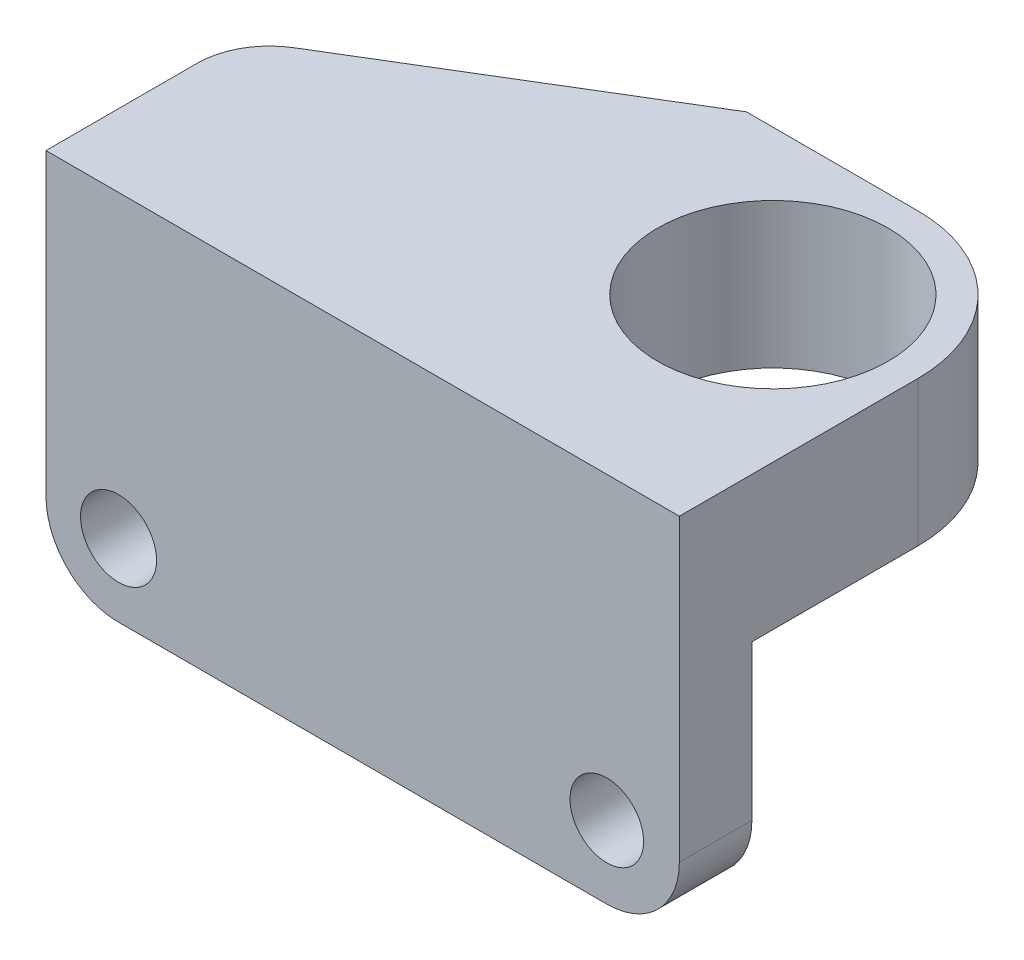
ISO-10303-21;
HEADER;
FILE_DESCRIPTION(('STEP AP214'),'2;1');
FILE_NAME('part.step','',(''),(''),'','','');
FILE_SCHEMA(('AUTOMOTIVE_DESIGN { 1 0 10303 214 1 1 1 1 }'));
ENDSEC;
DATA;
#1=APPLICATION_CONTEXT('core data for automotive mechanical design processes');
#2=APPLICATION_PROTOCOL_DEFINITION('international standard','automotive_design',2000,#1);
#3=PRODUCT_CONTEXT('',#1,'mechanical');
#4=PRODUCT('Part','Part','',(#3));
#5=PRODUCT_RELATED_PRODUCT_CATEGORY('part','',(#4));
#6=PRODUCT_DEFINITION_FORMATION('','',#4);
#7=PRODUCT_DEFINITION_CONTEXT('part definition',#1,'design');
#8=PRODUCT_DEFINITION('design','',#6,#7);
#9=PRODUCT_DEFINITION_SHAPE('','',#8);
#10=(LENGTH_UNIT() NAMED_UNIT(*) SI_UNIT(.MILLI.,.METRE.));
#11=(NAMED_UNIT(*) PLANE_ANGLE_UNIT() SI_UNIT($,.RADIAN.));
#12=(NAMED_UNIT(*) SI_UNIT($,.STERADIAN.) SOLID_ANGLE_UNIT());
#13=UNCERTAINTY_MEASURE_WITH_UNIT(LENGTH_MEASURE(1.E-05),#10,'distance_accuracy_value','');
#14=(GEOMETRIC_REPRESENTATION_CONTEXT(3) GLOBAL_UNCERTAINTY_ASSIGNED_CONTEXT((#13)) GLOBAL_UNIT_ASSIGNED_CONTEXT((#10,
#11,#12)) REPRESENTATION_CONTEXT('',''));
#15=CARTESIAN_POINT('',(0.,0.,0.));
#16=DIRECTION('',(0.,0.,1.));
#17=DIRECTION('',(1.,0.,0.));
#18=AXIS2_PLACEMENT_3D('',#15,#16,#17);
#19=CARTESIAN_POINT('',(87.3072795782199,41.3112987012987,-42.8935448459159));
#20=DIRECTION('',(0.,1.,0.));
#21=DIRECTION('',(0.,0.,1.));
#22=AXIS2_PLACEMENT_3D('',#19,#20,#21);
#23=PLANE('',#22);
#24=CARTESIAN_POINT('',(67.3072795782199,41.3112987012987,-22.8935448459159));
#25=DIRECTION('',(0.,-1.,0.));
#26=DIRECTION('',(0.,0.,-1.));
#27=AXIS2_PLACEMENT_3D('',#24,#25,#26);
#28=CIRCLE('',#27,20.);
#29=CARTESIAN_POINT('',(47.3072795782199,41.3112987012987,-22.8935448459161));
#30=VERTEX_POINT('',#29);
#31=CARTESIAN_POINT('',(67.3072795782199,41.3112987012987,-42.8935448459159));
#32=VERTEX_POINT('',#31);
#33=EDGE_CURVE('E138',#30,#32,#28,.T.);
#34=ORIENTED_EDGE('',*,*,#33,.F.);
#35=DIRECTION('',(0.,0.,-1.));
#36=VECTOR('',#35,1.);
#37=CARTESIAN_POINT('',(47.3072795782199,41.3112987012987,0.));
#38=LINE('',#37,#36);
#39=CARTESIAN_POINT('',(47.3072795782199,41.3112987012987,0.));
#40=VERTEX_POINT('',#39);
#41=EDGE_CURVE('E55',#40,#30,#38,.T.);
#42=ORIENTED_EDGE('',*,*,#41,.F.);
#43=DIRECTION('',(1.,0.,0.));
#44=VECTOR('',#43,1.);
#45=CARTESIAN_POINT('',(0.,41.3112987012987,0.));
#46=LINE('',#45,#44);
#47=CARTESIAN_POINT('',(0.,41.3112987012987,0.));
#48=VERTEX_POINT('',#47);
#49=EDGE_CURVE('E227',#48,#40,#46,.T.);
#50=ORIENTED_EDGE('',*,*,#49,.F.);
#51=DIRECTION('',(0.,0.,1.));
#52=VECTOR('',#51,1.);
#53=CARTESIAN_POINT('',(0.,41.3112987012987,10.));
#54=LINE('',#53,#52);
#55=CARTESIAN_POINT('',(0.,41.3112987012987,-10.8130763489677));
#56=VERTEX_POINT('',#55);
#57=EDGE_CURVE('E164',#56,#48,#54,.T.);
#58=ORIENTED_EDGE('',*,*,#57,.F.);
#59=CARTESIAN_POINT('',(10.,41.3112987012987,-10.8130763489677));
#60=DIRECTION('',(0.,1.,0.));
#61=DIRECTION('',(0.,0.,1.));
#62=AXIS2_PLACEMENT_3D('',#59,#60,#61);
#63=CIRCLE('',#62,10.);
#64=CARTESIAN_POINT('',(4.8184128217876,41.3112987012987,-19.3659211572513));
#65=VERTEX_POINT('',#64);
#66=EDGE_CURVE('E11',#56,#65,#63,.F.);
#67=ORIENTED_EDGE('',*,*,#66,.T.);
#68=DIRECTION('',(-0.855284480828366,0.,0.518158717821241));
#69=VECTOR('',#68,1.);
#70=CARTESIAN_POINT('',(43.65363978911,41.3112987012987,-42.8935448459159));
#71=LINE('',#70,#69);
#72=CARTESIAN_POINT('',(43.65363978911,41.3112987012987,-42.8935448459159));
#73=VERTEX_POINT('',#72);
#74=EDGE_CURVE('E160',#73,#65,#71,.T.);
#75=ORIENTED_EDGE('',*,*,#74,.F.);
#76=DIRECTION('',(-1.,0.,0.));
#77=VECTOR('',#76,1.);
#78=CARTESIAN_POINT('',(87.3072795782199,41.3112987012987,-42.8935448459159));
#79=LINE('',#78,#77);
#80=EDGE_CURVE('E158',#32,#73,#79,.T.);
#81=ORIENTED_EDGE('',*,*,#80,.F.);
#82=EDGE_LOOP('',(#34,#42,#50,#58,#67,#75,#81));
#83=FACE_BOUND('',#82,.T.);
#84=ADVANCED_FACE('F32',(#83),#23,.F.);
#85=CARTESIAN_POINT('',(0.,51.3112987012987,0.));
#86=DIRECTION('',(0.,0.,-1.));
#87=DIRECTION('',(-1.,0.,0.));
#88=AXIS2_PLACEMENT_3D('',#85,#86,#87);
#89=PLANE('',#88);
#90=DIRECTION('',(-1.,0.,0.));
#91=VECTOR('',#90,1.);
#92=CARTESIAN_POINT('',(87.3072795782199,31.3112987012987,0.));
#93=LINE('',#92,#91);
#94=CARTESIAN_POINT('',(87.3072795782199,31.3112987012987,0.));
#95=VERTEX_POINT('',#94);
#96=CARTESIAN_POINT('',(47.3072795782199,31.3112987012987,0.));
#97=VERTEX_POINT('',#96);
#98=EDGE_CURVE('E146',#95,#97,#93,.T.);
#99=ORIENTED_EDGE('',*,*,#98,.F.);
#100=DIRECTION('',(0.,1.,0.));
#101=VECTOR('',#100,1.);
#102=CARTESIAN_POINT('',(87.3072795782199,0.,0.));
#103=LINE('',#102,#101);
#104=CARTESIAN_POINT('',(87.3072795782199,10.,0.));
#105=VERTEX_POINT('',#104);
#106=EDGE_CURVE('E188',#105,#95,#103,.T.);
#107=ORIENTED_EDGE('',*,*,#106,.F.);
#108=CARTESIAN_POINT('',(77.3072795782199,10.,0.));
#109=DIRECTION('',(0.,0.,-1.));
#110=DIRECTION('',(-1.,0.,0.));
#111=AXIS2_PLACEMENT_3D('',#108,#109,#110);
#112=CIRCLE('',#111,10.);
#113=CARTESIAN_POINT('',(77.3072795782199,0.,0.));
#114=VERTEX_POINT('',#113);
#115=EDGE_CURVE('E212',#105,#114,#112,.T.);
#116=ORIENTED_EDGE('',*,*,#115,.T.);
#117=DIRECTION('',(1.,0.,0.));
#118=VECTOR('',#117,1.);
#119=CARTESIAN_POINT('',(0.,0.,0.));
#120=LINE('',#119,#118);
#121=CARTESIAN_POINT('',(10.,0.,0.));
#122=VERTEX_POINT('',#121);
#123=EDGE_CURVE('E197',#122,#114,#120,.T.);
#124=ORIENTED_EDGE('',*,*,#123,.F.);
#125=CARTESIAN_POINT('',(10.,10.,0.));
#126=DIRECTION('',(0.,0.,-1.));
#127=DIRECTION('',(-1.,0.,0.));
#128=AXIS2_PLACEMENT_3D('',#125,#126,#127);
#129=CIRCLE('',#128,10.);
#130=CARTESIAN_POINT('',(0.,10.,0.));
#131=VERTEX_POINT('',#130);
#132=EDGE_CURVE('E214',#122,#131,#129,.T.);
#133=ORIENTED_EDGE('',*,*,#132,.T.);
#134=DIRECTION('',(0.,-1.,0.));
#135=VECTOR('',#134,1.);
#136=CARTESIAN_POINT('',(0.,0.,0.));
#137=LINE('',#136,#135);
#138=EDGE_CURVE('E182',#48,#131,#137,.T.);
#139=ORIENTED_EDGE('',*,*,#138,.F.);
#140=ORIENTED_EDGE('',*,*,#49,.T.);
#141=DIRECTION('',(0.,-1.,0.));
#142=VECTOR('',#141,1.);
#143=CARTESIAN_POINT('',(47.3072795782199,87.3994142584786,0.));
#144=LINE('',#143,#142);
#145=EDGE_CURVE('E47',#40,#97,#144,.T.);
#146=ORIENTED_EDGE('',*,*,#145,.T.);
#147=EDGE_LOOP('',(#99,#107,#116,#124,#133,#139,#140,#146));
#148=FACE_BOUND('',#147,.T.);
#149=CARTESIAN_POINT('',(10.,10.,0.));
#150=DIRECTION('',(0.,0.,1.));
#151=DIRECTION('',(1.,0.,0.));
#152=AXIS2_PLACEMENT_3D('',#149,#150,#151);
#153=CIRCLE('',#152,5.23946139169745);
#154=CARTESIAN_POINT('',(15.2394613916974,10.,0.));
#155=VERTEX_POINT('',#154);
#156=EDGE_CURVE('E179',#155,#155,#153,.T.);
#157=ORIENTED_EDGE('',*,*,#156,.T.);
#158=EDGE_LOOP('',(#157));
#159=FACE_BOUND('',#158,.T.);
#160=CARTESIAN_POINT('',(77.3072795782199,10.,0.));
#161=DIRECTION('',(0.,0.,1.));
#162=DIRECTION('',(1.,0.,0.));
#163=AXIS2_PLACEMENT_3D('',#160,#161,#162);
#164=CIRCLE('',#163,5.07179578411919);
#165=CARTESIAN_POINT('',(82.3790753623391,10.,0.));
#166=VERTEX_POINT('',#165);
#167=EDGE_CURVE('E173',#166,#166,#164,.T.);
#168=ORIENTED_EDGE('',*,*,#167,.T.);
#169=EDGE_LOOP('',(#168));
#170=FACE_BOUND('',#169,.T.);
#171=ADVANCED_FACE('F276',(#148,#159,#170),#89,.T.);
#172=CARTESIAN_POINT('',(0.,0.,10.));
#173=DIRECTION('',(1.,0.,0.));
#174=DIRECTION('',(0.,0.,-1.));
#175=AXIS2_PLACEMENT_3D('',#172,#173,#174);
#176=PLANE('',#175);
#177=DIRECTION('',(0.,0.,-1.));
#178=VECTOR('',#177,1.);
#179=CARTESIAN_POINT('',(0.,51.3112987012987,10.));
#180=LINE('',#179,#178);
#181=CARTESIAN_POINT('',(0.,51.3112987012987,10.));
#182=VERTEX_POINT('',#181);
#183=CARTESIAN_POINT('',(0.,51.3112987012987,-10.8130763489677));
#184=VERTEX_POINT('',#183);
#185=EDGE_CURVE('E195',#182,#184,#180,.T.);
#186=ORIENTED_EDGE('',*,*,#185,.T.);
#187=DIRECTION('',(0.,1.,0.));
#188=VECTOR('',#187,1.);
#189=CARTESIAN_POINT('',(0.,41.3112987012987,-10.8130763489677));
#190=LINE('',#189,#188);
#191=EDGE_CURVE('E40',#184,#56,#190,.F.);
#192=ORIENTED_EDGE('',*,*,#191,.T.);
#193=ORIENTED_EDGE('',*,*,#57,.T.);
#194=ORIENTED_EDGE('',*,*,#138,.T.);
#195=DIRECTION('',(0.,0.,-1.));
#196=VECTOR('',#195,1.);
#197=CARTESIAN_POINT('',(0.,10.,10.));
#198=LINE('',#197,#196);
#199=CARTESIAN_POINT('',(0.,10.,10.));
#200=VERTEX_POINT('',#199);
#201=EDGE_CURVE('E217',#131,#200,#198,.F.);
#202=ORIENTED_EDGE('',*,*,#201,.T.);
#203=DIRECTION('',(0.,-1.,0.));
#204=VECTOR('',#203,1.);
#205=CARTESIAN_POINT('',(0.,0.,10.));
#206=LINE('',#205,#204);
#207=EDGE_CURVE('E185',#182,#200,#206,.T.);
#208=ORIENTED_EDGE('',*,*,#207,.F.);
#209=EDGE_LOOP('',(#186,#192,#193,#194,#202,#208));
#210=FACE_BOUND('',#209,.T.);
#211=ADVANCED_FACE('F242',(#210),#176,.F.);
#212=CARTESIAN_POINT('',(0.,0.,10.));
#213=DIRECTION('',(0.,1.,0.));
#214=DIRECTION('',(0.,0.,1.));
#215=AXIS2_PLACEMENT_3D('',#212,#213,#214);
#216=PLANE('',#215);
#217=DIRECTION('',(1.,0.,0.));
#218=VECTOR('',#217,1.);
#219=CARTESIAN_POINT('',(0.,0.,10.));
#220=LINE('',#219,#218);
#221=CARTESIAN_POINT('',(10.,0.,10.));
#222=VERTEX_POINT('',#221);
#223=CARTESIAN_POINT('',(77.3072795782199,0.,10.));
#224=VERTEX_POINT('',#223);
#225=EDGE_CURVE('E187',#222,#224,#220,.T.);
#226=ORIENTED_EDGE('',*,*,#225,.F.);
#227=DIRECTION('',(0.,0.,-1.));
#228=VECTOR('',#227,1.);
#229=CARTESIAN_POINT('',(10.,0.,10.));
#230=LINE('',#229,#228);
#231=EDGE_CURVE('E209',#222,#122,#230,.T.);
#232=ORIENTED_EDGE('',*,*,#231,.T.);
#233=ORIENTED_EDGE('',*,*,#123,.T.);
#234=DIRECTION('',(0.,0.,-1.));
#235=VECTOR('',#234,1.);
#236=CARTESIAN_POINT('',(77.3072795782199,0.,10.));
#237=LINE('',#236,#235);
#238=EDGE_CURVE('E207',#114,#224,#237,.F.);
#239=ORIENTED_EDGE('',*,*,#238,.T.);
#240=EDGE_LOOP('',(#226,#232,#233,#239));
#241=FACE_BOUND('',#240,.T.);
#242=ADVANCED_FACE('F280',(#241),#216,.F.);
#243=CARTESIAN_POINT('',(87.3072795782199,0.,10.));
#244=DIRECTION('',(-1.,0.,0.));
#245=DIRECTION('',(0.,0.,1.));
#246=AXIS2_PLACEMENT_3D('',#243,#244,#245);
#247=PLANE('',#246);
#248=DIRECTION('',(0.,0.,1.));
#249=VECTOR('',#248,1.);
#250=CARTESIAN_POINT('',(87.3072795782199,31.3112987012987,-22.8935448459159));
#251=LINE('',#250,#249);
#252=CARTESIAN_POINT('',(87.3072795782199,31.3112987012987,-22.8935448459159));
#253=VERTEX_POINT('',#252);
#254=EDGE_CURVE('E149',#253,#95,#251,.T.);
#255=ORIENTED_EDGE('',*,*,#254,.F.);
#256=DIRECTION('',(0.,1.,0.));
#257=VECTOR('',#256,1.);
#258=CARTESIAN_POINT('',(87.3072795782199,51.3112987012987,-22.8935448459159));
#259=LINE('',#258,#257);
#260=CARTESIAN_POINT('',(87.3072795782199,51.3112987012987,-22.8935448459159));
#261=VERTEX_POINT('',#260);
#262=EDGE_CURVE('E132',#253,#261,#259,.T.);
#263=ORIENTED_EDGE('',*,*,#262,.T.);
#264=DIRECTION('',(0.,0.,-1.));
#265=VECTOR('',#264,1.);
#266=CARTESIAN_POINT('',(87.3072795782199,51.3112987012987,10.));
#267=LINE('',#266,#265);
#268=CARTESIAN_POINT('',(87.3072795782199,51.3112987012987,10.));
#269=VERTEX_POINT('',#268);
#270=EDGE_CURVE('E204',#269,#261,#267,.T.);
#271=ORIENTED_EDGE('',*,*,#270,.F.);
#272=DIRECTION('',(0.,1.,0.));
#273=VECTOR('',#272,1.);
#274=CARTESIAN_POINT('',(87.3072795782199,0.,10.));
#275=LINE('',#274,#273);
#276=CARTESIAN_POINT('',(87.3072795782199,10.,10.));
#277=VERTEX_POINT('',#276);
#278=EDGE_CURVE('E191',#277,#269,#275,.T.);
#279=ORIENTED_EDGE('',*,*,#278,.F.);
#280=DIRECTION('',(0.,0.,-1.));
#281=VECTOR('',#280,1.);
#282=CARTESIAN_POINT('',(87.3072795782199,10.,10.));
#283=LINE('',#282,#281);
#284=EDGE_CURVE('E224',#277,#105,#283,.T.);
#285=ORIENTED_EDGE('',*,*,#284,.T.);
#286=ORIENTED_EDGE('',*,*,#106,.T.);
#287=EDGE_LOOP('',(#255,#263,#271,#279,#285,#286));
#288=FACE_BOUND('',#287,.T.);
#289=ADVANCED_FACE('F263',(#288),#247,.F.);
#290=CARTESIAN_POINT('',(0.,51.3112987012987,10.));
#291=DIRECTION('',(0.,-1.,0.));
#292=DIRECTION('',(0.,0.,-1.));
#293=AXIS2_PLACEMENT_3D('',#290,#291,#292);
#294=PLANE('',#293);
#295=CARTESIAN_POINT('',(67.3072795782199,51.3112987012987,-22.8935448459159));
#296=DIRECTION('',(0.,-1.,0.));
#297=DIRECTION('',(0.,0.,-1.));
#298=AXIS2_PLACEMENT_3D('',#295,#296,#297);
#299=CIRCLE('',#298,15.9054257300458);
#300=CARTESIAN_POINT('',(67.3072795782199,51.3112987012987,-38.7989705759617));
#301=VERTEX_POINT('',#300);
#302=EDGE_CURVE('E152',#301,#301,#299,.T.);
#303=ORIENTED_EDGE('',*,*,#302,.T.);
#304=EDGE_LOOP('',(#303));
#305=FACE_BOUND('',#304,.T.);
#306=DIRECTION('',(-0.855284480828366,0.,0.518158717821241));
#307=VECTOR('',#306,1.);
#308=CARTESIAN_POINT('',(43.65363978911,51.3112987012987,-42.8935448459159));
#309=LINE('',#308,#307);
#310=CARTESIAN_POINT('',(43.65363978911,51.3112987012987,-42.8935448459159));
#311=VERTEX_POINT('',#310);
#312=CARTESIAN_POINT('',(4.8184128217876,51.3112987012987,-19.3659211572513));
#313=VERTEX_POINT('',#312);
#314=EDGE_CURVE('E161',#311,#313,#309,.T.);
#315=ORIENTED_EDGE('',*,*,#314,.T.);
#316=CARTESIAN_POINT('',(10.,51.3112987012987,-10.8130763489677));
#317=DIRECTION('',(0.,-1.,0.));
#318=DIRECTION('',(0.,0.,-1.));
#319=AXIS2_PLACEMENT_3D('',#316,#317,#318);
#320=CIRCLE('',#319,10.);
#321=EDGE_CURVE('E238',#313,#184,#320,.F.);
#322=ORIENTED_EDGE('',*,*,#321,.T.);
#323=ORIENTED_EDGE('',*,*,#185,.F.);
#324=DIRECTION('',(-1.,0.,0.));
#325=VECTOR('',#324,1.);
#326=CARTESIAN_POINT('',(0.,51.3112987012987,10.));
#327=LINE('',#326,#325);
#328=EDGE_CURVE('E193',#269,#182,#327,.T.);
#329=ORIENTED_EDGE('',*,*,#328,.F.);
#330=ORIENTED_EDGE('',*,*,#270,.T.);
#331=CARTESIAN_POINT('',(67.3072795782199,51.3112987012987,-22.8935448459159));
#332=DIRECTION('',(0.,-1.,0.));
#333=DIRECTION('',(0.,0.,-1.));
#334=AXIS2_PLACEMENT_3D('',#331,#332,#333);
#335=CIRCLE('',#334,20.);
#336=CARTESIAN_POINT('',(67.3072795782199,51.3112987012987,-42.8935448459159));
#337=VERTEX_POINT('',#336);
#338=EDGE_CURVE('E230',#261,#337,#335,.F.);
#339=ORIENTED_EDGE('',*,*,#338,.T.);
#340=DIRECTION('',(-1.,0.,0.));
#341=VECTOR('',#340,1.);
#342=CARTESIAN_POINT('',(87.3072795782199,51.3112987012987,-42.8935448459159));
#343=LINE('',#342,#341);
#344=EDGE_CURVE('E137',#337,#311,#343,.T.);
#345=ORIENTED_EDGE('',*,*,#344,.T.);
#346=EDGE_LOOP('',(#315,#322,#323,#329,#330,#339,#345));
#347=FACE_BOUND('',#346,.T.);
#348=ADVANCED_FACE('F255',(#305,#347),#294,.F.);
#349=CARTESIAN_POINT('',(0.,51.3112987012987,10.));
#350=DIRECTION('',(0.,0.,-1.));
#351=DIRECTION('',(-1.,0.,0.));
#352=AXIS2_PLACEMENT_3D('',#349,#350,#351);
#353=PLANE('',#352);
#354=ORIENTED_EDGE('',*,*,#207,.T.);
#355=CARTESIAN_POINT('',(10.,10.,10.));
#356=DIRECTION('',(0.,0.,-1.));
#357=DIRECTION('',(-1.,0.,0.));
#358=AXIS2_PLACEMENT_3D('',#355,#356,#357);
#359=CIRCLE('',#358,10.);
#360=EDGE_CURVE('E222',#200,#222,#359,.F.);
#361=ORIENTED_EDGE('',*,*,#360,.T.);
#362=ORIENTED_EDGE('',*,*,#225,.T.);
#363=CARTESIAN_POINT('',(77.3072795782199,10.,10.));
#364=DIRECTION('',(0.,0.,-1.));
#365=DIRECTION('',(-1.,0.,0.));
#366=AXIS2_PLACEMENT_3D('',#363,#364,#365);
#367=CIRCLE('',#366,10.);
#368=EDGE_CURVE('E220',#224,#277,#367,.F.);
#369=ORIENTED_EDGE('',*,*,#368,.T.);
#370=ORIENTED_EDGE('',*,*,#278,.T.);
#371=ORIENTED_EDGE('',*,*,#328,.T.);
#372=EDGE_LOOP('',(#354,#361,#362,#369,#370,#371));
#373=FACE_BOUND('',#372,.T.);
#374=CARTESIAN_POINT('',(10.,10.,10.));
#375=DIRECTION('',(0.,0.,1.));
#376=DIRECTION('',(1.,0.,0.));
#377=AXIS2_PLACEMENT_3D('',#374,#375,#376);
#378=CIRCLE('',#377,5.23946139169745);
#379=CARTESIAN_POINT('',(15.2394613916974,10.,10.));
#380=VERTEX_POINT('',#379);
#381=EDGE_CURVE('E176',#380,#380,#378,.T.);
#382=ORIENTED_EDGE('',*,*,#381,.F.);
#383=EDGE_LOOP('',(#382));
#384=FACE_BOUND('',#383,.T.);
#385=CARTESIAN_POINT('',(77.3072795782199,10.,10.));
#386=DIRECTION('',(0.,0.,1.));
#387=DIRECTION('',(1.,0.,0.));
#388=AXIS2_PLACEMENT_3D('',#385,#386,#387);
#389=CIRCLE('',#388,5.07179578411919);
#390=CARTESIAN_POINT('',(82.3790753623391,10.,10.));
#391=VERTEX_POINT('',#390);
#392=EDGE_CURVE('E172',#391,#391,#389,.T.);
#393=ORIENTED_EDGE('',*,*,#392,.F.);
#394=EDGE_LOOP('',(#393));
#395=FACE_BOUND('',#394,.T.);
#396=ADVANCED_FACE('F267',(#373,#384,#395),#353,.F.);
#397=CARTESIAN_POINT('',(10.,10.,0.));
#398=DIRECTION('',(0.,0.,1.));
#399=DIRECTION('',(1.,0.,0.));
#400=AXIS2_PLACEMENT_3D('',#397,#398,#399);
#401=CYLINDRICAL_SURFACE('',#400,5.23946139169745);
#402=ORIENTED_EDGE('',*,*,#156,.F.);
#403=EDGE_LOOP('',(#402));
#404=FACE_BOUND('',#403,.T.);
#405=ORIENTED_EDGE('',*,*,#381,.T.);
#406=EDGE_LOOP('',(#405));
#407=FACE_BOUND('',#406,.T.);
#408=ADVANCED_FACE('F294',(#404,#407),#401,.F.);
#409=CARTESIAN_POINT('',(77.3072795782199,10.,0.));
#410=DIRECTION('',(0.,0.,1.));
#411=DIRECTION('',(1.,0.,0.));
#412=AXIS2_PLACEMENT_3D('',#409,#410,#411);
#413=CYLINDRICAL_SURFACE('',#412,5.07179578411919);
#414=ORIENTED_EDGE('',*,*,#167,.F.);
#415=EDGE_LOOP('',(#414));
#416=FACE_BOUND('',#415,.T.);
#417=ORIENTED_EDGE('',*,*,#392,.T.);
#418=EDGE_LOOP('',(#417));
#419=FACE_BOUND('',#418,.T.);
#420=ADVANCED_FACE('F287',(#416,#419),#413,.F.);
#421=CARTESIAN_POINT('',(10.,10.,10.));
#422=DIRECTION('',(0.,0.,-1.));
#423=DIRECTION('',(-1.,0.,0.));
#424=AXIS2_PLACEMENT_3D('',#421,#422,#423);
#425=CYLINDRICAL_SURFACE('',#424,10.);
#426=ORIENTED_EDGE('',*,*,#360,.F.);
#427=ORIENTED_EDGE('',*,*,#201,.F.);
#428=ORIENTED_EDGE('',*,*,#132,.F.);
#429=ORIENTED_EDGE('',*,*,#231,.F.);
#430=EDGE_LOOP('',(#426,#427,#428,#429));
#431=FACE_BOUND('',#430,.T.);
#432=ADVANCED_FACE('F284',(#431),#425,.T.);
#433=CARTESIAN_POINT('',(77.3072795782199,10.,10.));
#434=DIRECTION('',(0.,0.,-1.));
#435=DIRECTION('',(-1.,0.,0.));
#436=AXIS2_PLACEMENT_3D('',#433,#434,#435);
#437=CYLINDRICAL_SURFACE('',#436,10.);
#438=ORIENTED_EDGE('',*,*,#368,.F.);
#439=ORIENTED_EDGE('',*,*,#238,.F.);
#440=ORIENTED_EDGE('',*,*,#115,.F.);
#441=ORIENTED_EDGE('',*,*,#284,.F.);
#442=EDGE_LOOP('',(#438,#439,#440,#441));
#443=FACE_BOUND('',#442,.T.);
#444=ADVANCED_FACE('F273',(#443),#437,.T.);
#445=CARTESIAN_POINT('',(43.65363978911,41.3112987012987,-42.8935448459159));
#446=DIRECTION('',(-0.518158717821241,0.,-0.855284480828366));
#447=DIRECTION('',(-0.855284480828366,0.,0.518158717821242));
#448=AXIS2_PLACEMENT_3D('',#445,#446,#447);
#449=PLANE('',#448);
#450=ORIENTED_EDGE('',*,*,#74,.T.);
#451=DIRECTION('',(0.,1.,0.));
#452=VECTOR('',#451,1.);
#453=CARTESIAN_POINT('',(4.81841282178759,51.3112987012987,-19.3659211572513));
#454=LINE('',#453,#452);
#455=EDGE_CURVE('E235',#65,#313,#454,.T.);
#456=ORIENTED_EDGE('',*,*,#455,.T.);
#457=ORIENTED_EDGE('',*,*,#314,.F.);
#458=DIRECTION('',(0.,1.,0.));
#459=VECTOR('',#458,1.);
#460=CARTESIAN_POINT('',(43.65363978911,41.3112987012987,-42.8935448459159));
#461=LINE('',#460,#459);
#462=EDGE_CURVE('E166',#73,#311,#461,.T.);
#463=ORIENTED_EDGE('',*,*,#462,.F.);
#464=EDGE_LOOP('',(#450,#456,#457,#463));
#465=FACE_BOUND('',#464,.T.);
#466=ADVANCED_FACE('F252',(#465),#449,.T.);
#467=CARTESIAN_POINT('',(87.3072795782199,41.3112987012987,-42.8935448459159));
#468=DIRECTION('',(0.,0.,-1.));
#469=DIRECTION('',(-1.,0.,0.));
#470=AXIS2_PLACEMENT_3D('',#467,#468,#469);
#471=PLANE('',#470);
#472=ORIENTED_EDGE('',*,*,#344,.F.);
#473=DIRECTION('',(0.,1.,0.));
#474=VECTOR('',#473,1.);
#475=CARTESIAN_POINT('',(67.3072795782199,41.3112987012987,-42.8935448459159));
#476=LINE('',#475,#474);
#477=EDGE_CURVE('E232',#337,#32,#476,.F.);
#478=ORIENTED_EDGE('',*,*,#477,.T.);
#479=ORIENTED_EDGE('',*,*,#80,.T.);
#480=ORIENTED_EDGE('',*,*,#462,.T.);
#481=EDGE_LOOP('',(#472,#478,#479,#480));
#482=FACE_BOUND('',#481,.T.);
#483=ADVANCED_FACE('F259',(#482),#471,.T.);
#484=CARTESIAN_POINT('',(67.3072795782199,0.,-22.8935448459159));
#485=DIRECTION('',(0.,-1.,0.));
#486=DIRECTION('',(0.,0.,-1.));
#487=AXIS2_PLACEMENT_3D('',#484,#485,#486);
#488=CYLINDRICAL_SURFACE('',#487,20.);
#489=ORIENTED_EDGE('',*,*,#262,.F.);
#490=CARTESIAN_POINT('',(67.3072795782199,31.3112987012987,-22.8935448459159));
#491=DIRECTION('',(0.,-1.,0.));
#492=DIRECTION('',(0.,0.,-1.));
#493=AXIS2_PLACEMENT_3D('',#490,#491,#492);
#494=CIRCLE('',#493,20.);
#495=CARTESIAN_POINT('',(47.3072795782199,31.3112987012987,-22.8935448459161));
#496=VERTEX_POINT('',#495);
#497=EDGE_CURVE('E127',#496,#253,#494,.T.);
#498=ORIENTED_EDGE('',*,*,#497,.F.);
#499=DIRECTION('',(0.,-1.,0.));
#500=VECTOR('',#499,1.);
#501=CARTESIAN_POINT('',(47.3072795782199,87.3994142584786,-22.8935448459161));
#502=LINE('',#501,#500);
#503=EDGE_CURVE('E130',#30,#496,#502,.T.);
#504=ORIENTED_EDGE('',*,*,#503,.F.);
#505=ORIENTED_EDGE('',*,*,#33,.T.);
#506=ORIENTED_EDGE('',*,*,#477,.F.);
#507=ORIENTED_EDGE('',*,*,#338,.F.);
#508=EDGE_LOOP('',(#489,#498,#504,#505,#506,#507));
#509=FACE_BOUND('',#508,.T.);
#510=ADVANCED_FACE('F129',(#509),#488,.T.);
#511=CARTESIAN_POINT('',(10.,41.3112987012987,-10.8130763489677));
#512=DIRECTION('',(0.,-1.,0.));
#513=DIRECTION('',(0.,0.,-1.));
#514=AXIS2_PLACEMENT_3D('',#511,#512,#513);
#515=CYLINDRICAL_SURFACE('',#514,10.);
#516=ORIENTED_EDGE('',*,*,#66,.F.);
#517=ORIENTED_EDGE('',*,*,#191,.F.);
#518=ORIENTED_EDGE('',*,*,#321,.F.);
#519=ORIENTED_EDGE('',*,*,#455,.F.);
#520=EDGE_LOOP('',(#516,#517,#518,#519));
#521=FACE_BOUND('',#520,.T.);
#522=ADVANCED_FACE('F34',(#521),#515,.T.);
#523=CARTESIAN_POINT('',(67.3072795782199,31.3112987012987,-22.8935448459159));
#524=DIRECTION('',(0.,-1.,0.));
#525=DIRECTION('',(0.,0.,-1.));
#526=AXIS2_PLACEMENT_3D('',#523,#524,#525);
#527=PLANE('',#526);
#528=CARTESIAN_POINT('',(67.3072795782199,31.3112987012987,-22.8935448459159));
#529=DIRECTION('',(0.,-1.,0.));
#530=DIRECTION('',(0.,0.,-1.));
#531=AXIS2_PLACEMENT_3D('',#528,#529,#530);
#532=CIRCLE('',#531,15.9054257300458);
#533=CARTESIAN_POINT('',(67.3072795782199,31.3112987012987,-38.7989705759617));
#534=VERTEX_POINT('',#533);
#535=EDGE_CURVE('E449',#534,#534,#532,.T.);
#536=ORIENTED_EDGE('',*,*,#535,.F.);
#537=EDGE_LOOP('',(#536));
#538=FACE_BOUND('',#537,.T.);
#539=ORIENTED_EDGE('',*,*,#497,.T.);
#540=ORIENTED_EDGE('',*,*,#254,.T.);
#541=ORIENTED_EDGE('',*,*,#98,.T.);
#542=DIRECTION('',(0.,0.,-1.));
#543=VECTOR('',#542,1.);
#544=CARTESIAN_POINT('',(47.3072795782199,31.3112987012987,0.));
#545=LINE('',#544,#543);
#546=EDGE_CURVE('E143',#97,#496,#545,.T.);
#547=ORIENTED_EDGE('',*,*,#546,.T.);
#548=EDGE_LOOP('',(#539,#540,#541,#547));
#549=FACE_BOUND('',#548,.T.);
#550=ADVANCED_FACE('F145',(#538,#549),#527,.T.);
#551=CARTESIAN_POINT('',(47.3072795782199,87.3994142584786,0.));
#552=DIRECTION('',(-1.,0.,0.));
#553=DIRECTION('',(0.,0.,1.));
#554=AXIS2_PLACEMENT_3D('',#551,#552,#553);
#555=PLANE('',#554);
#556=ORIENTED_EDGE('',*,*,#145,.F.);
#557=ORIENTED_EDGE('',*,*,#41,.T.);
#558=ORIENTED_EDGE('',*,*,#503,.T.);
#559=ORIENTED_EDGE('',*,*,#546,.F.);
#560=EDGE_LOOP('',(#556,#557,#558,#559));
#561=FACE_BOUND('',#560,.T.);
#562=ADVANCED_FACE('F142',(#561),#555,.T.);
#563=CARTESIAN_POINT('',(67.3072795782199,101.311298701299,-22.8935448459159));
#564=DIRECTION('',(0.,-1.,0.));
#565=DIRECTION('',(0.,0.,-1.));
#566=AXIS2_PLACEMENT_3D('',#563,#564,#565);
#567=CYLINDRICAL_SURFACE('',#566,15.9054257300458);
#568=ORIENTED_EDGE('',*,*,#535,.T.);
#569=EDGE_LOOP('',(#568));
#570=FACE_BOUND('',#569,.T.);
#571=ORIENTED_EDGE('',*,*,#302,.F.);
#572=EDGE_LOOP('',(#571));
#573=FACE_BOUND('',#572,.T.);
#574=ADVANCED_FACE('F430',(#570,#573),#567,.F.);
#575=CLOSED_SHELL('',(#84,#171,#211,#242,#289,#348,#396,#408,#420,#432,#444,#466,#483,#510,#522,
#550,#562,#574));
#576=MANIFOLD_SOLID_BREP('B2',#575);
#577=ADVANCED_BREP_SHAPE_REPRESENTATION('',(#18,#576),#14);
#578=SHAPE_DEFINITION_REPRESENTATION(#9,#577);
ENDSEC;
END-ISO-10303-21;
